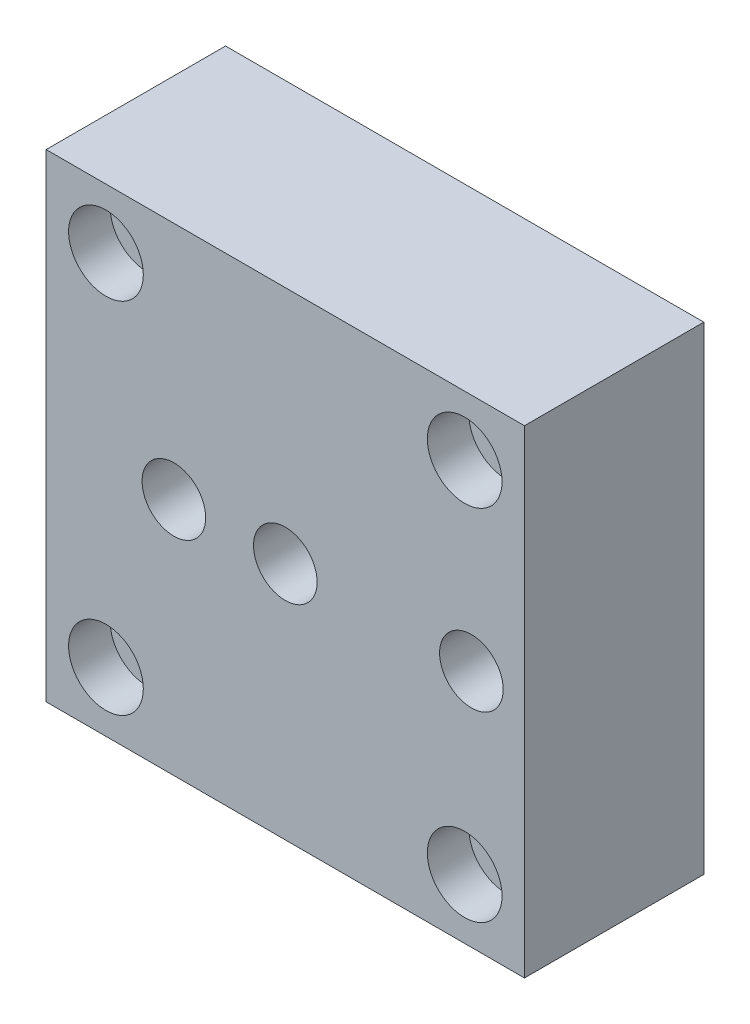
ISO-10303-21;
HEADER;
FILE_DESCRIPTION(('STEP AP214'),'2;1');
FILE_NAME('part.step','',(''),(''),'','','');
FILE_SCHEMA(('AUTOMOTIVE_DESIGN { 1 0 10303 214 1 1 1 1 }'));
ENDSEC;
DATA;
#1=APPLICATION_CONTEXT('core data for automotive mechanical design processes');
#2=APPLICATION_PROTOCOL_DEFINITION('international standard','automotive_design',2000,#1);
#3=PRODUCT_CONTEXT('',#1,'mechanical');
#4=PRODUCT('Part','Part','',(#3));
#5=PRODUCT_RELATED_PRODUCT_CATEGORY('part','',(#4));
#6=PRODUCT_DEFINITION_FORMATION('','',#4);
#7=PRODUCT_DEFINITION_CONTEXT('part definition',#1,'design');
#8=PRODUCT_DEFINITION('design','',#6,#7);
#9=PRODUCT_DEFINITION_SHAPE('','',#8);
#10=(LENGTH_UNIT() NAMED_UNIT(*) SI_UNIT(.MILLI.,.METRE.));
#11=(NAMED_UNIT(*) PLANE_ANGLE_UNIT() SI_UNIT($,.RADIAN.));
#12=(NAMED_UNIT(*) SI_UNIT($,.STERADIAN.) SOLID_ANGLE_UNIT());
#13=UNCERTAINTY_MEASURE_WITH_UNIT(LENGTH_MEASURE(1.E-05),#10,'distance_accuracy_value','');
#14=(GEOMETRIC_REPRESENTATION_CONTEXT(3) GLOBAL_UNCERTAINTY_ASSIGNED_CONTEXT((#13)) GLOBAL_UNIT_ASSIGNED_CONTEXT((#10,
#11,#12)) REPRESENTATION_CONTEXT('',''));
#15=CARTESIAN_POINT('',(0.,0.,0.));
#16=DIRECTION('',(0.,0.,1.));
#17=DIRECTION('',(1.,0.,0.));
#18=AXIS2_PLACEMENT_3D('',#15,#16,#17);
#19=CARTESIAN_POINT('',(25.4,25.4,19.05));
#20=DIRECTION('',(-1.,0.,0.));
#21=DIRECTION('',(0.,-1.,0.));
#22=AXIS2_PLACEMENT_3D('',#19,#20,#21);
#23=PLANE('',#22);
#24=DIRECTION('',(0.,1.,0.));
#25=VECTOR('',#24,1.);
#26=CARTESIAN_POINT('',(25.4,25.4,0.));
#27=LINE('',#26,#25);
#28=CARTESIAN_POINT('',(25.4,-25.4,0.));
#29=VERTEX_POINT('',#28);
#30=CARTESIAN_POINT('',(25.4,25.4,0.));
#31=VERTEX_POINT('',#30);
#32=EDGE_CURVE('E97',#29,#31,#27,.T.);
#33=ORIENTED_EDGE('',*,*,#32,.T.);
#34=DIRECTION('',(0.,0.,-1.));
#35=VECTOR('',#34,1.);
#36=CARTESIAN_POINT('',(25.4,25.4,19.05));
#37=LINE('',#36,#35);
#38=CARTESIAN_POINT('',(25.4,25.4,19.05));
#39=VERTEX_POINT('',#38);
#40=EDGE_CURVE('E11',#39,#31,#37,.T.);
#41=ORIENTED_EDGE('',*,*,#40,.F.);
#42=DIRECTION('',(0.,1.,0.));
#43=VECTOR('',#42,1.);
#44=CARTESIAN_POINT('',(25.4,25.4,19.05));
#45=LINE('',#44,#43);
#46=CARTESIAN_POINT('',(25.4,-25.4,19.05));
#47=VERTEX_POINT('',#46);
#48=EDGE_CURVE('E85',#47,#39,#45,.T.);
#49=ORIENTED_EDGE('',*,*,#48,.F.);
#50=DIRECTION('',(0.,0.,-1.));
#51=VECTOR('',#50,1.);
#52=CARTESIAN_POINT('',(25.4,-25.4,19.05));
#53=LINE('',#52,#51);
#54=EDGE_CURVE('E93',#47,#29,#53,.T.);
#55=ORIENTED_EDGE('',*,*,#54,.T.);
#56=EDGE_LOOP('',(#33,#41,#49,#55));
#57=FACE_BOUND('',#56,.T.);
#58=ADVANCED_FACE('F34',(#57),#23,.F.);
#59=CARTESIAN_POINT('',(-25.4,25.4,19.05));
#60=DIRECTION('',(0.,-1.,0.));
#61=DIRECTION('',(0.,0.,-1.));
#62=AXIS2_PLACEMENT_3D('',#59,#60,#61);
#63=PLANE('',#62);
#64=DIRECTION('',(-1.,0.,0.));
#65=VECTOR('',#64,1.);
#66=CARTESIAN_POINT('',(-25.4,25.4,0.));
#67=LINE('',#66,#65);
#68=CARTESIAN_POINT('',(-25.4,25.4,0.));
#69=VERTEX_POINT('',#68);
#70=EDGE_CURVE('E89',#31,#69,#67,.T.);
#71=ORIENTED_EDGE('',*,*,#70,.T.);
#72=DIRECTION('',(0.,0.,-1.));
#73=VECTOR('',#72,1.);
#74=CARTESIAN_POINT('',(-25.4,25.4,19.05));
#75=LINE('',#74,#73);
#76=CARTESIAN_POINT('',(-25.4,25.4,19.05));
#77=VERTEX_POINT('',#76);
#78=EDGE_CURVE('E42',#77,#69,#75,.T.);
#79=ORIENTED_EDGE('',*,*,#78,.F.);
#80=DIRECTION('',(-1.,0.,0.));
#81=VECTOR('',#80,1.);
#82=CARTESIAN_POINT('',(-25.4,25.4,19.05));
#83=LINE('',#82,#81);
#84=EDGE_CURVE('E80',#39,#77,#83,.T.);
#85=ORIENTED_EDGE('',*,*,#84,.F.);
#86=ORIENTED_EDGE('',*,*,#40,.T.);
#87=EDGE_LOOP('',(#71,#79,#85,#86));
#88=FACE_BOUND('',#87,.T.);
#89=ADVANCED_FACE('F88',(#88),#63,.F.);
#90=CARTESIAN_POINT('',(-25.4,25.4,19.05));
#91=DIRECTION('',(1.,0.,0.));
#92=DIRECTION('',(0.,1.,0.));
#93=AXIS2_PLACEMENT_3D('',#90,#91,#92);
#94=PLANE('',#93);
#95=DIRECTION('',(0.,-1.,0.));
#96=VECTOR('',#95,1.);
#97=CARTESIAN_POINT('',(-25.4,25.4,0.));
#98=LINE('',#97,#96);
#99=CARTESIAN_POINT('',(-25.4,-25.4,0.));
#100=VERTEX_POINT('',#99);
#101=EDGE_CURVE('E67',#69,#100,#98,.T.);
#102=ORIENTED_EDGE('',*,*,#101,.T.);
#103=DIRECTION('',(0.,0.,-1.));
#104=VECTOR('',#103,1.);
#105=CARTESIAN_POINT('',(-25.4,-25.4,19.05));
#106=LINE('',#105,#104);
#107=CARTESIAN_POINT('',(-25.4,-25.4,19.05));
#108=VERTEX_POINT('',#107);
#109=EDGE_CURVE('E90',#108,#100,#106,.T.);
#110=ORIENTED_EDGE('',*,*,#109,.F.);
#111=DIRECTION('',(0.,-1.,0.));
#112=VECTOR('',#111,1.);
#113=CARTESIAN_POINT('',(-25.4,25.4,19.05));
#114=LINE('',#113,#112);
#115=EDGE_CURVE('E83',#77,#108,#114,.T.);
#116=ORIENTED_EDGE('',*,*,#115,.F.);
#117=ORIENTED_EDGE('',*,*,#78,.T.);
#118=EDGE_LOOP('',(#102,#110,#116,#117));
#119=FACE_BOUND('',#118,.T.);
#120=ADVANCED_FACE('F91',(#119),#94,.F.);
#121=CARTESIAN_POINT('',(-25.4,-25.4,19.05));
#122=DIRECTION('',(0.,1.,0.));
#123=DIRECTION('',(0.,0.,1.));
#124=AXIS2_PLACEMENT_3D('',#121,#122,#123);
#125=PLANE('',#124);
#126=DIRECTION('',(1.,0.,0.));
#127=VECTOR('',#126,1.);
#128=CARTESIAN_POINT('',(-25.4,-25.4,0.));
#129=LINE('',#128,#127);
#130=EDGE_CURVE('E73',#100,#29,#129,.T.);
#131=ORIENTED_EDGE('',*,*,#130,.T.);
#132=ORIENTED_EDGE('',*,*,#54,.F.);
#133=DIRECTION('',(1.,0.,0.));
#134=VECTOR('',#133,1.);
#135=CARTESIAN_POINT('',(-25.4,-25.4,19.05));
#136=LINE('',#135,#134);
#137=EDGE_CURVE('E50',#108,#47,#136,.T.);
#138=ORIENTED_EDGE('',*,*,#137,.F.);
#139=ORIENTED_EDGE('',*,*,#109,.T.);
#140=EDGE_LOOP('',(#131,#132,#138,#139));
#141=FACE_BOUND('',#140,.T.);
#142=ADVANCED_FACE('F105',(#141),#125,.F.);
#143=CARTESIAN_POINT('',(0.,0.,19.05));
#144=DIRECTION('',(0.,0.,1.));
#145=DIRECTION('',(1.,0.,0.));
#146=AXIS2_PLACEMENT_3D('',#143,#144,#145);
#147=PLANE('',#146);
#148=CARTESIAN_POINT('',(19.7612,0.,19.05));
#149=DIRECTION('',(0.,0.,1.));
#150=DIRECTION('',(1.,0.,0.));
#151=AXIS2_PLACEMENT_3D('',#148,#149,#150);
#152=CIRCLE('',#151,3.3782);
#153=CARTESIAN_POINT('',(23.1394,0.,19.05));
#154=VERTEX_POINT('',#153);
#155=EDGE_CURVE('E171',#154,#154,#152,.T.);
#156=ORIENTED_EDGE('',*,*,#155,.F.);
#157=EDGE_LOOP('',(#156));
#158=FACE_BOUND('',#157,.T.);
#159=CARTESIAN_POINT('',(-11.8364,0.,19.05));
#160=DIRECTION('',(0.,0.,1.));
#161=DIRECTION('',(1.,0.,0.));
#162=AXIS2_PLACEMENT_3D('',#159,#160,#161);
#163=CIRCLE('',#162,3.3782);
#164=CARTESIAN_POINT('',(-8.45820000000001,0.,19.05));
#165=VERTEX_POINT('',#164);
#166=EDGE_CURVE('E165',#165,#165,#163,.T.);
#167=ORIENTED_EDGE('',*,*,#166,.F.);
#168=EDGE_LOOP('',(#167));
#169=FACE_BOUND('',#168,.T.);
#170=CARTESIAN_POINT('',(0.,0.,19.05));
#171=DIRECTION('',(0.,0.,1.));
#172=DIRECTION('',(1.,0.,0.));
#173=AXIS2_PLACEMENT_3D('',#170,#171,#172);
#174=CIRCLE('',#173,3.3782);
#175=CARTESIAN_POINT('',(3.3782,0.,19.05));
#176=VERTEX_POINT('',#175);
#177=EDGE_CURVE('E159',#176,#176,#174,.T.);
#178=ORIENTED_EDGE('',*,*,#177,.F.);
#179=EDGE_LOOP('',(#178));
#180=FACE_BOUND('',#179,.T.);
#181=CARTESIAN_POINT('',(-19.05,19.05,19.05));
#182=DIRECTION('',(0.,0.,1.));
#183=DIRECTION('',(1.,0.,0.));
#184=AXIS2_PLACEMENT_3D('',#181,#182,#183);
#185=CIRCLE('',#184,3.96875);
#186=CARTESIAN_POINT('',(-15.08125,19.05,19.05));
#187=VERTEX_POINT('',#186);
#188=EDGE_CURVE('E155',#187,#187,#185,.T.);
#189=ORIENTED_EDGE('',*,*,#188,.F.);
#190=EDGE_LOOP('',(#189));
#191=FACE_BOUND('',#190,.T.);
#192=CARTESIAN_POINT('',(19.05,19.05,19.05));
#193=DIRECTION('',(0.,0.,1.));
#194=DIRECTION('',(1.,0.,0.));
#195=AXIS2_PLACEMENT_3D('',#192,#193,#194);
#196=CIRCLE('',#195,3.96875);
#197=CARTESIAN_POINT('',(23.01875,19.05,19.05));
#198=VERTEX_POINT('',#197);
#199=EDGE_CURVE('E143',#198,#198,#196,.T.);
#200=ORIENTED_EDGE('',*,*,#199,.F.);
#201=EDGE_LOOP('',(#200));
#202=FACE_BOUND('',#201,.T.);
#203=CARTESIAN_POINT('',(-19.05,-19.05,19.05));
#204=DIRECTION('',(0.,0.,1.));
#205=DIRECTION('',(1.,0.,0.));
#206=AXIS2_PLACEMENT_3D('',#203,#204,#205);
#207=CIRCLE('',#206,3.96875);
#208=CARTESIAN_POINT('',(-15.08125,-19.05,19.05));
#209=VERTEX_POINT('',#208);
#210=EDGE_CURVE('E131',#209,#209,#207,.T.);
#211=ORIENTED_EDGE('',*,*,#210,.F.);
#212=EDGE_LOOP('',(#211));
#213=FACE_BOUND('',#212,.T.);
#214=CARTESIAN_POINT('',(19.05,-19.05,19.05));
#215=DIRECTION('',(0.,0.,1.));
#216=DIRECTION('',(1.,0.,0.));
#217=AXIS2_PLACEMENT_3D('',#214,#215,#216);
#218=CIRCLE('',#217,3.96875);
#219=CARTESIAN_POINT('',(23.01875,-19.05,19.05));
#220=VERTEX_POINT('',#219);
#221=EDGE_CURVE('E119',#220,#220,#218,.T.);
#222=ORIENTED_EDGE('',*,*,#221,.F.);
#223=EDGE_LOOP('',(#222));
#224=FACE_BOUND('',#223,.T.);
#225=ORIENTED_EDGE('',*,*,#48,.T.);
#226=ORIENTED_EDGE('',*,*,#84,.T.);
#227=ORIENTED_EDGE('',*,*,#115,.T.);
#228=ORIENTED_EDGE('',*,*,#137,.T.);
#229=EDGE_LOOP('',(#225,#226,#227,#228));
#230=FACE_BOUND('',#229,.T.);
#231=ADVANCED_FACE('F81',(#158,#169,#180,#191,#202,#213,#224,#230),#147,.T.);
#232=CARTESIAN_POINT('',(0.,0.,0.));
#233=DIRECTION('',(0.,0.,1.));
#234=DIRECTION('',(1.,0.,0.));
#235=AXIS2_PLACEMENT_3D('',#232,#233,#234);
#236=PLANE('',#235);
#237=CARTESIAN_POINT('',(19.7612,0.,0.));
#238=DIRECTION('',(0.,0.,1.));
#239=DIRECTION('',(1.,0.,0.));
#240=AXIS2_PLACEMENT_3D('',#237,#238,#239);
#241=CIRCLE('',#240,3.3782);
#242=CARTESIAN_POINT('',(23.1394,0.,0.));
#243=VERTEX_POINT('',#242);
#244=EDGE_CURVE('E162',#243,#243,#241,.T.);
#245=ORIENTED_EDGE('',*,*,#244,.T.);
#246=EDGE_LOOP('',(#245));
#247=FACE_BOUND('',#246,.T.);
#248=CARTESIAN_POINT('',(-11.8364,0.,0.));
#249=DIRECTION('',(0.,0.,1.));
#250=DIRECTION('',(1.,0.,0.));
#251=AXIS2_PLACEMENT_3D('',#248,#249,#250);
#252=CIRCLE('',#251,3.3782);
#253=CARTESIAN_POINT('',(-8.45820000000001,0.,0.));
#254=VERTEX_POINT('',#253);
#255=EDGE_CURVE('E168',#254,#254,#252,.T.);
#256=ORIENTED_EDGE('',*,*,#255,.T.);
#257=EDGE_LOOP('',(#256));
#258=FACE_BOUND('',#257,.T.);
#259=CARTESIAN_POINT('',(0.,0.,0.));
#260=DIRECTION('',(0.,0.,1.));
#261=DIRECTION('',(1.,0.,0.));
#262=AXIS2_PLACEMENT_3D('',#259,#260,#261);
#263=CIRCLE('',#262,3.3782);
#264=CARTESIAN_POINT('',(3.3782,0.,0.));
#265=VERTEX_POINT('',#264);
#266=EDGE_CURVE('E158',#265,#265,#263,.T.);
#267=ORIENTED_EDGE('',*,*,#266,.T.);
#268=EDGE_LOOP('',(#267));
#269=FACE_BOUND('',#268,.T.);
#270=CARTESIAN_POINT('',(-19.05,19.05,0.));
#271=DIRECTION('',(0.,0.,1.));
#272=DIRECTION('',(1.,0.,0.));
#273=AXIS2_PLACEMENT_3D('',#270,#271,#272);
#274=CIRCLE('',#273,2.15265);
#275=CARTESIAN_POINT('',(-16.89735,19.05,0.));
#276=VERTEX_POINT('',#275);
#277=EDGE_CURVE('E146',#276,#276,#274,.T.);
#278=ORIENTED_EDGE('',*,*,#277,.T.);
#279=EDGE_LOOP('',(#278));
#280=FACE_BOUND('',#279,.T.);
#281=CARTESIAN_POINT('',(19.05,19.05,0.));
#282=DIRECTION('',(0.,0.,1.));
#283=DIRECTION('',(1.,0.,0.));
#284=AXIS2_PLACEMENT_3D('',#281,#282,#283);
#285=CIRCLE('',#284,2.15265);
#286=CARTESIAN_POINT('',(21.20265,19.05,0.));
#287=VERTEX_POINT('',#286);
#288=EDGE_CURVE('E134',#287,#287,#285,.T.);
#289=ORIENTED_EDGE('',*,*,#288,.T.);
#290=EDGE_LOOP('',(#289));
#291=FACE_BOUND('',#290,.T.);
#292=CARTESIAN_POINT('',(-19.05,-19.05,0.));
#293=DIRECTION('',(0.,0.,1.));
#294=DIRECTION('',(1.,0.,0.));
#295=AXIS2_PLACEMENT_3D('',#292,#293,#294);
#296=CIRCLE('',#295,2.15265);
#297=CARTESIAN_POINT('',(-16.89735,-19.05,0.));
#298=VERTEX_POINT('',#297);
#299=EDGE_CURVE('E122',#298,#298,#296,.T.);
#300=ORIENTED_EDGE('',*,*,#299,.T.);
#301=EDGE_LOOP('',(#300));
#302=FACE_BOUND('',#301,.T.);
#303=CARTESIAN_POINT('',(19.05,-19.05,0.));
#304=DIRECTION('',(0.,0.,1.));
#305=DIRECTION('',(1.,0.,0.));
#306=AXIS2_PLACEMENT_3D('',#303,#304,#305);
#307=CIRCLE('',#306,2.15265);
#308=CARTESIAN_POINT('',(21.20265,-19.05,0.));
#309=VERTEX_POINT('',#308);
#310=EDGE_CURVE('E100',#309,#309,#307,.T.);
#311=ORIENTED_EDGE('',*,*,#310,.T.);
#312=EDGE_LOOP('',(#311));
#313=FACE_BOUND('',#312,.T.);
#314=ORIENTED_EDGE('',*,*,#32,.F.);
#315=ORIENTED_EDGE('',*,*,#130,.F.);
#316=ORIENTED_EDGE('',*,*,#101,.F.);
#317=ORIENTED_EDGE('',*,*,#70,.F.);
#318=EDGE_LOOP('',(#314,#315,#316,#317));
#319=FACE_BOUND('',#318,.T.);
#320=ADVANCED_FACE('F108',(#247,#258,#269,#280,#291,#302,#313,#319),#236,.F.);
#321=CARTESIAN_POINT('',(19.05,-19.05,19.05));
#322=DIRECTION('',(0.,0.,1.));
#323=DIRECTION('',(1.,0.,0.));
#324=AXIS2_PLACEMENT_3D('',#321,#322,#323);
#325=CYLINDRICAL_SURFACE('',#324,2.15265);
#326=ORIENTED_EDGE('',*,*,#310,.F.);
#327=EDGE_LOOP('',(#326));
#328=FACE_BOUND('',#327,.T.);
#329=CARTESIAN_POINT('',(19.05,-19.05,14.6304));
#330=DIRECTION('',(0.,0.,1.));
#331=DIRECTION('',(1.,0.,0.));
#332=AXIS2_PLACEMENT_3D('',#329,#330,#331);
#333=CIRCLE('',#332,2.15265000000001);
#334=CARTESIAN_POINT('',(21.20265,-19.05,14.6304));
#335=VERTEX_POINT('',#334);
#336=EDGE_CURVE('E113',#335,#335,#333,.T.);
#337=ORIENTED_EDGE('',*,*,#336,.T.);
#338=EDGE_LOOP('',(#337));
#339=FACE_BOUND('',#338,.T.);
#340=ADVANCED_FACE('F214',(#328,#339),#325,.F.);
#341=CARTESIAN_POINT('',(21.20265,-19.05,14.6304));
#342=DIRECTION('',(0.,0.,-1.));
#343=DIRECTION('',(-1.,0.,0.));
#344=AXIS2_PLACEMENT_3D('',#341,#342,#343);
#345=PLANE('',#344);
#346=ORIENTED_EDGE('',*,*,#336,.F.);
#347=EDGE_LOOP('',(#346));
#348=FACE_BOUND('',#347,.T.);
#349=CARTESIAN_POINT('',(19.05,-19.05,14.6304));
#350=DIRECTION('',(0.,0.,1.));
#351=DIRECTION('',(1.,0.,0.));
#352=AXIS2_PLACEMENT_3D('',#349,#350,#351);
#353=CIRCLE('',#352,3.96875);
#354=CARTESIAN_POINT('',(23.01875,-19.05,14.6304));
#355=VERTEX_POINT('',#354);
#356=EDGE_CURVE('E116',#355,#355,#353,.T.);
#357=ORIENTED_EDGE('',*,*,#356,.T.);
#358=EDGE_LOOP('',(#357));
#359=FACE_BOUND('',#358,.T.);
#360=ADVANCED_FACE('F204',(#348,#359),#345,.F.);
#361=CARTESIAN_POINT('',(19.05,-19.05,19.05));
#362=DIRECTION('',(0.,0.,1.));
#363=DIRECTION('',(1.,0.,0.));
#364=AXIS2_PLACEMENT_3D('',#361,#362,#363);
#365=CYLINDRICAL_SURFACE('',#364,3.96875);
#366=ORIENTED_EDGE('',*,*,#356,.F.);
#367=EDGE_LOOP('',(#366));
#368=FACE_BOUND('',#367,.T.);
#369=ORIENTED_EDGE('',*,*,#221,.T.);
#370=EDGE_LOOP('',(#369));
#371=FACE_BOUND('',#370,.T.);
#372=ADVANCED_FACE('F201',(#368,#371),#365,.F.);
#373=CARTESIAN_POINT('',(-19.05,-19.05,19.05));
#374=DIRECTION('',(0.,0.,1.));
#375=DIRECTION('',(1.,0.,0.));
#376=AXIS2_PLACEMENT_3D('',#373,#374,#375);
#377=CYLINDRICAL_SURFACE('',#376,2.15265);
#378=ORIENTED_EDGE('',*,*,#299,.F.);
#379=EDGE_LOOP('',(#378));
#380=FACE_BOUND('',#379,.T.);
#381=CARTESIAN_POINT('',(-19.05,-19.05,14.6304));
#382=DIRECTION('',(0.,0.,1.));
#383=DIRECTION('',(1.,0.,0.));
#384=AXIS2_PLACEMENT_3D('',#381,#382,#383);
#385=CIRCLE('',#384,2.15265000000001);
#386=CARTESIAN_POINT('',(-16.89735,-19.05,14.6304));
#387=VERTEX_POINT('',#386);
#388=EDGE_CURVE('E125',#387,#387,#385,.T.);
#389=ORIENTED_EDGE('',*,*,#388,.T.);
#390=EDGE_LOOP('',(#389));
#391=FACE_BOUND('',#390,.T.);
#392=ADVANCED_FACE('F203',(#380,#391),#377,.F.);
#393=CARTESIAN_POINT('',(-16.89735,-19.05,14.6304));
#394=DIRECTION('',(0.,0.,-1.));
#395=DIRECTION('',(-1.,0.,0.));
#396=AXIS2_PLACEMENT_3D('',#393,#394,#395);
#397=PLANE('',#396);
#398=ORIENTED_EDGE('',*,*,#388,.F.);
#399=EDGE_LOOP('',(#398));
#400=FACE_BOUND('',#399,.T.);
#401=CARTESIAN_POINT('',(-19.05,-19.05,14.6304));
#402=DIRECTION('',(0.,0.,1.));
#403=DIRECTION('',(1.,0.,0.));
#404=AXIS2_PLACEMENT_3D('',#401,#402,#403);
#405=CIRCLE('',#404,3.96875);
#406=CARTESIAN_POINT('',(-15.08125,-19.05,14.6304));
#407=VERTEX_POINT('',#406);
#408=EDGE_CURVE('E128',#407,#407,#405,.T.);
#409=ORIENTED_EDGE('',*,*,#408,.T.);
#410=EDGE_LOOP('',(#409));
#411=FACE_BOUND('',#410,.T.);
#412=ADVANCED_FACE('F211',(#400,#411),#397,.F.);
#413=CARTESIAN_POINT('',(-19.05,-19.05,19.05));
#414=DIRECTION('',(0.,0.,1.));
#415=DIRECTION('',(1.,0.,0.));
#416=AXIS2_PLACEMENT_3D('',#413,#414,#415);
#417=CYLINDRICAL_SURFACE('',#416,3.96875);
#418=ORIENTED_EDGE('',*,*,#408,.F.);
#419=EDGE_LOOP('',(#418));
#420=FACE_BOUND('',#419,.T.);
#421=ORIENTED_EDGE('',*,*,#210,.T.);
#422=EDGE_LOOP('',(#421));
#423=FACE_BOUND('',#422,.T.);
#424=ADVANCED_FACE('F266',(#420,#423),#417,.F.);
#425=CARTESIAN_POINT('',(19.05,19.05,19.05));
#426=DIRECTION('',(0.,0.,1.));
#427=DIRECTION('',(1.,0.,0.));
#428=AXIS2_PLACEMENT_3D('',#425,#426,#427);
#429=CYLINDRICAL_SURFACE('',#428,2.15265);
#430=ORIENTED_EDGE('',*,*,#288,.F.);
#431=EDGE_LOOP('',(#430));
#432=FACE_BOUND('',#431,.T.);
#433=CARTESIAN_POINT('',(19.05,19.05,14.6304));
#434=DIRECTION('',(0.,0.,1.));
#435=DIRECTION('',(1.,0.,0.));
#436=AXIS2_PLACEMENT_3D('',#433,#434,#435);
#437=CIRCLE('',#436,2.15265000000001);
#438=CARTESIAN_POINT('',(21.20265,19.05,14.6304));
#439=VERTEX_POINT('',#438);
#440=EDGE_CURVE('E137',#439,#439,#437,.T.);
#441=ORIENTED_EDGE('',*,*,#440,.T.);
#442=EDGE_LOOP('',(#441));
#443=FACE_BOUND('',#442,.T.);
#444=ADVANCED_FACE('F276',(#432,#443),#429,.F.);
#445=CARTESIAN_POINT('',(21.20265,19.05,14.6304));
#446=DIRECTION('',(0.,0.,-1.));
#447=DIRECTION('',(-1.,0.,0.));
#448=AXIS2_PLACEMENT_3D('',#445,#446,#447);
#449=PLANE('',#448);
#450=ORIENTED_EDGE('',*,*,#440,.F.);
#451=EDGE_LOOP('',(#450));
#452=FACE_BOUND('',#451,.T.);
#453=CARTESIAN_POINT('',(19.05,19.05,14.6304));
#454=DIRECTION('',(0.,0.,1.));
#455=DIRECTION('',(1.,0.,0.));
#456=AXIS2_PLACEMENT_3D('',#453,#454,#455);
#457=CIRCLE('',#456,3.96875);
#458=CARTESIAN_POINT('',(23.01875,19.05,14.6304));
#459=VERTEX_POINT('',#458);
#460=EDGE_CURVE('E140',#459,#459,#457,.T.);
#461=ORIENTED_EDGE('',*,*,#460,.T.);
#462=EDGE_LOOP('',(#461));
#463=FACE_BOUND('',#462,.T.);
#464=ADVANCED_FACE('F286',(#452,#463),#449,.F.);
#465=CARTESIAN_POINT('',(19.05,19.05,19.05));
#466=DIRECTION('',(0.,0.,1.));
#467=DIRECTION('',(1.,0.,0.));
#468=AXIS2_PLACEMENT_3D('',#465,#466,#467);
#469=CYLINDRICAL_SURFACE('',#468,3.96875);
#470=ORIENTED_EDGE('',*,*,#460,.F.);
#471=EDGE_LOOP('',(#470));
#472=FACE_BOUND('',#471,.T.);
#473=ORIENTED_EDGE('',*,*,#199,.T.);
#474=EDGE_LOOP('',(#473));
#475=FACE_BOUND('',#474,.T.);
#476=ADVANCED_FACE('F296',(#472,#475),#469,.F.);
#477=CARTESIAN_POINT('',(-19.05,19.05,19.05));
#478=DIRECTION('',(0.,0.,1.));
#479=DIRECTION('',(1.,0.,0.));
#480=AXIS2_PLACEMENT_3D('',#477,#478,#479);
#481=CYLINDRICAL_SURFACE('',#480,2.15265);
#482=ORIENTED_EDGE('',*,*,#277,.F.);
#483=EDGE_LOOP('',(#482));
#484=FACE_BOUND('',#483,.T.);
#485=CARTESIAN_POINT('',(-19.05,19.05,14.6304));
#486=DIRECTION('',(0.,0.,1.));
#487=DIRECTION('',(1.,0.,0.));
#488=AXIS2_PLACEMENT_3D('',#485,#486,#487);
#489=CIRCLE('',#488,2.15265000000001);
#490=CARTESIAN_POINT('',(-16.89735,19.05,14.6304));
#491=VERTEX_POINT('',#490);
#492=EDGE_CURVE('E149',#491,#491,#489,.T.);
#493=ORIENTED_EDGE('',*,*,#492,.T.);
#494=EDGE_LOOP('',(#493));
#495=FACE_BOUND('',#494,.T.);
#496=ADVANCED_FACE('F306',(#484,#495),#481,.F.);
#497=CARTESIAN_POINT('',(-16.89735,19.05,14.6304));
#498=DIRECTION('',(0.,0.,-1.));
#499=DIRECTION('',(-1.,0.,0.));
#500=AXIS2_PLACEMENT_3D('',#497,#498,#499);
#501=PLANE('',#500);
#502=ORIENTED_EDGE('',*,*,#492,.F.);
#503=EDGE_LOOP('',(#502));
#504=FACE_BOUND('',#503,.T.);
#505=CARTESIAN_POINT('',(-19.05,19.05,14.6304));
#506=DIRECTION('',(0.,0.,1.));
#507=DIRECTION('',(1.,0.,0.));
#508=AXIS2_PLACEMENT_3D('',#505,#506,#507);
#509=CIRCLE('',#508,3.96875);
#510=CARTESIAN_POINT('',(-15.08125,19.05,14.6304));
#511=VERTEX_POINT('',#510);
#512=EDGE_CURVE('E152',#511,#511,#509,.T.);
#513=ORIENTED_EDGE('',*,*,#512,.T.);
#514=EDGE_LOOP('',(#513));
#515=FACE_BOUND('',#514,.T.);
#516=ADVANCED_FACE('F316',(#504,#515),#501,.F.);
#517=CARTESIAN_POINT('',(-19.05,19.05,19.05));
#518=DIRECTION('',(0.,0.,1.));
#519=DIRECTION('',(1.,0.,0.));
#520=AXIS2_PLACEMENT_3D('',#517,#518,#519);
#521=CYLINDRICAL_SURFACE('',#520,3.96875);
#522=ORIENTED_EDGE('',*,*,#512,.F.);
#523=EDGE_LOOP('',(#522));
#524=FACE_BOUND('',#523,.T.);
#525=ORIENTED_EDGE('',*,*,#188,.T.);
#526=EDGE_LOOP('',(#525));
#527=FACE_BOUND('',#526,.T.);
#528=ADVANCED_FACE('F326',(#524,#527),#521,.F.);
#529=CARTESIAN_POINT('',(0.,0.,0.));
#530=DIRECTION('',(0.,0.,1.));
#531=DIRECTION('',(1.,0.,0.));
#532=AXIS2_PLACEMENT_3D('',#529,#530,#531);
#533=CYLINDRICAL_SURFACE('',#532,3.3782);
#534=CARTESIAN_POINT('',(3.3782,0.,0.));
#535=CARTESIAN_POINT('',(3.3782,0.,0.1984375));
#536=CARTESIAN_POINT('',(3.3782,0.,0.396875));
#537=CARTESIAN_POINT('',(3.3782,0.,0.79375));
#538=CARTESIAN_POINT('',(3.3782,0.,0.9921875));
#539=CARTESIAN_POINT('',(3.3782,0.,1.3890625));
#540=CARTESIAN_POINT('',(3.3782,0.,1.5875));
#541=CARTESIAN_POINT('',(3.3782,0.,1.984375));
#542=CARTESIAN_POINT('',(3.3782,0.,2.1828125));
#543=CARTESIAN_POINT('',(3.3782,0.,2.5796875));
#544=CARTESIAN_POINT('',(3.3782,0.,2.778125));
#545=CARTESIAN_POINT('',(3.3782,0.,3.175));
#546=CARTESIAN_POINT('',(3.3782,0.,3.3734375));
#547=CARTESIAN_POINT('',(3.3782,0.,3.7703125));
#548=CARTESIAN_POINT('',(3.3782,0.,3.96875));
#549=CARTESIAN_POINT('',(3.3782,0.,4.365625));
#550=CARTESIAN_POINT('',(3.3782,0.,4.5640625));
#551=CARTESIAN_POINT('',(3.3782,0.,4.9609375));
#552=CARTESIAN_POINT('',(3.3782,0.,5.159375));
#553=CARTESIAN_POINT('',(3.3782,0.,5.55625));
#554=CARTESIAN_POINT('',(3.3782,0.,5.7546875));
#555=CARTESIAN_POINT('',(3.3782,0.,6.1515625));
#556=CARTESIAN_POINT('',(3.3782,0.,6.35));
#557=CARTESIAN_POINT('',(3.3782,0.,6.746875));
#558=CARTESIAN_POINT('',(3.3782,0.,6.9453125));
#559=CARTESIAN_POINT('',(3.3782,0.,7.3421875));
#560=CARTESIAN_POINT('',(3.3782,0.,7.540625));
#561=CARTESIAN_POINT('',(3.3782,0.,7.9375));
#562=CARTESIAN_POINT('',(3.3782,0.,8.1359375));
#563=CARTESIAN_POINT('',(3.3782,0.,8.5328125));
#564=CARTESIAN_POINT('',(3.3782,0.,8.73125));
#565=CARTESIAN_POINT('',(3.3782,0.,9.128125));
#566=CARTESIAN_POINT('',(3.3782,0.,9.3265625));
#567=CARTESIAN_POINT('',(3.3782,0.,9.7234375));
#568=CARTESIAN_POINT('',(3.3782,0.,9.921875));
#569=CARTESIAN_POINT('',(3.3782,0.,10.31875));
#570=CARTESIAN_POINT('',(3.3782,0.,10.5171875));
#571=CARTESIAN_POINT('',(3.3782,0.,10.9140625));
#572=CARTESIAN_POINT('',(3.3782,0.,11.1125));
#573=CARTESIAN_POINT('',(3.3782,0.,11.509375));
#574=CARTESIAN_POINT('',(3.3782,0.,11.7078125));
#575=CARTESIAN_POINT('',(3.3782,0.,12.1046875));
#576=CARTESIAN_POINT('',(3.3782,0.,12.303125));
#577=CARTESIAN_POINT('',(3.3782,0.,12.7));
#578=CARTESIAN_POINT('',(3.3782,0.,12.8984375));
#579=CARTESIAN_POINT('',(3.3782,0.,13.2953125));
#580=CARTESIAN_POINT('',(3.3782,0.,13.49375));
#581=CARTESIAN_POINT('',(3.3782,0.,13.890625));
#582=CARTESIAN_POINT('',(3.3782,0.,14.0890625));
#583=CARTESIAN_POINT('',(3.3782,0.,14.4859375));
#584=CARTESIAN_POINT('',(3.3782,0.,14.684375));
#585=CARTESIAN_POINT('',(3.3782,0.,15.08125));
#586=CARTESIAN_POINT('',(3.3782,0.,15.2796875));
#587=CARTESIAN_POINT('',(3.3782,0.,15.6765625));
#588=CARTESIAN_POINT('',(3.3782,0.,15.875));
#589=CARTESIAN_POINT('',(3.3782,0.,16.271875));
#590=CARTESIAN_POINT('',(3.3782,0.,16.4703125));
#591=CARTESIAN_POINT('',(3.3782,0.,16.8671875));
#592=CARTESIAN_POINT('',(3.3782,0.,17.065625));
#593=CARTESIAN_POINT('',(3.3782,0.,17.4625));
#594=CARTESIAN_POINT('',(3.3782,0.,17.6609375));
#595=CARTESIAN_POINT('',(3.3782,0.,18.0578125));
#596=CARTESIAN_POINT('',(3.3782,0.,18.25625));
#597=CARTESIAN_POINT('',(3.3782,0.,18.653125));
#598=CARTESIAN_POINT('',(3.3782,0.,18.8515625));
#599=CARTESIAN_POINT('',(3.3782,0.,19.05));
#600=B_SPLINE_CURVE_WITH_KNOTS('',3,(#534,#535,#536,#537,#538,#539,#540,#541,#542,#543,#544,
#545,#546,#547,#548,#549,#550,#551,#552,#553,#554,#555,#556,#557,#558,#559,#560,#561,#562,#563,
#564,#565,#566,#567,#568,#569,#570,#571,#572,#573,#574,#575,#576,#577,#578,#579,#580,#581,#582,
#583,#584,#585,#586,#587,#588,#589,#590,#591,#592,#593,#594,#595,#596,#597,#598,#599),
.UNSPECIFIED.,.F.,.F.,(4,2,2,2,2,2,2,2,2,2,2,2,2,2,2,2,2,2,2,2,2,2,2,2,2,2,2,2,2,2,2,2,4),(0.,
0.5953125,1.190625,1.7859375,2.38125,2.9765625,3.571875,4.1671875,4.7625,5.3578125,5.953125,
6.5484375,7.14375,7.7390625,8.334375,8.9296875,9.525,10.1203125,10.715625,11.3109375,11.90625,
12.5015625,13.096875,13.6921875,14.2875,14.8828125,15.478125,16.0734375,16.66875,17.2640625,
17.859375,18.4546875,19.05),.UNSPECIFIED.);
#601=EDGE_CURVE('BSEAM336',#265,#176,#600,.T.);
#602=ORIENTED_EDGE('',*,*,#266,.F.);
#603=ORIENTED_EDGE('',*,*,#177,.T.);
#604=ORIENTED_EDGE('',*,*,#601,.T.);
#605=ORIENTED_EDGE('',*,*,#601,.F.);
#606=EDGE_LOOP('',(#602,#604,#603,#605));
#607=FACE_BOUND('',#606,.T.);
#608=ADVANCED_FACE('F336',(#607),#533,.F.);
#609=CARTESIAN_POINT('',(-11.8364,0.,0.));
#610=DIRECTION('',(0.,0.,1.));
#611=DIRECTION('',(1.,0.,0.));
#612=AXIS2_PLACEMENT_3D('',#609,#610,#611);
#613=CYLINDRICAL_SURFACE('',#612,3.3782);
#614=CARTESIAN_POINT('',(-8.45820000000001,0.,0.));
#615=CARTESIAN_POINT('',(-8.45820000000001,0.,0.1984375));
#616=CARTESIAN_POINT('',(-8.45820000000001,0.,0.396875));
#617=CARTESIAN_POINT('',(-8.45820000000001,0.,0.79375));
#618=CARTESIAN_POINT('',(-8.45820000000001,0.,0.9921875));
#619=CARTESIAN_POINT('',(-8.45820000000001,0.,1.3890625));
#620=CARTESIAN_POINT('',(-8.45820000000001,0.,1.5875));
#621=CARTESIAN_POINT('',(-8.45820000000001,0.,1.984375));
#622=CARTESIAN_POINT('',(-8.45820000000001,0.,2.1828125));
#623=CARTESIAN_POINT('',(-8.45820000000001,0.,2.5796875));
#624=CARTESIAN_POINT('',(-8.45820000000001,0.,2.778125));
#625=CARTESIAN_POINT('',(-8.45820000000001,0.,3.175));
#626=CARTESIAN_POINT('',(-8.45820000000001,0.,3.3734375));
#627=CARTESIAN_POINT('',(-8.45820000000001,0.,3.7703125));
#628=CARTESIAN_POINT('',(-8.45820000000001,0.,3.96875));
#629=CARTESIAN_POINT('',(-8.45820000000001,0.,4.365625));
#630=CARTESIAN_POINT('',(-8.45820000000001,0.,4.5640625));
#631=CARTESIAN_POINT('',(-8.45820000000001,0.,4.9609375));
#632=CARTESIAN_POINT('',(-8.45820000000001,0.,5.159375));
#633=CARTESIAN_POINT('',(-8.45820000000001,0.,5.55625));
#634=CARTESIAN_POINT('',(-8.45820000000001,0.,5.7546875));
#635=CARTESIAN_POINT('',(-8.45820000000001,0.,6.1515625));
#636=CARTESIAN_POINT('',(-8.45820000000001,0.,6.35));
#637=CARTESIAN_POINT('',(-8.45820000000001,0.,6.746875));
#638=CARTESIAN_POINT('',(-8.45820000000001,0.,6.9453125));
#639=CARTESIAN_POINT('',(-8.45820000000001,0.,7.3421875));
#640=CARTESIAN_POINT('',(-8.45820000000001,0.,7.540625));
#641=CARTESIAN_POINT('',(-8.45820000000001,0.,7.9375));
#642=CARTESIAN_POINT('',(-8.45820000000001,0.,8.1359375));
#643=CARTESIAN_POINT('',(-8.45820000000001,0.,8.5328125));
#644=CARTESIAN_POINT('',(-8.45820000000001,0.,8.73125));
#645=CARTESIAN_POINT('',(-8.45820000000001,0.,9.128125));
#646=CARTESIAN_POINT('',(-8.45820000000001,0.,9.3265625));
#647=CARTESIAN_POINT('',(-8.45820000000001,0.,9.7234375));
#648=CARTESIAN_POINT('',(-8.45820000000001,0.,9.921875));
#649=CARTESIAN_POINT('',(-8.45820000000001,0.,10.31875));
#650=CARTESIAN_POINT('',(-8.45820000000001,0.,10.5171875));
#651=CARTESIAN_POINT('',(-8.45820000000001,0.,10.9140625));
#652=CARTESIAN_POINT('',(-8.45820000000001,0.,11.1125));
#653=CARTESIAN_POINT('',(-8.45820000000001,0.,11.509375));
#654=CARTESIAN_POINT('',(-8.45820000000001,0.,11.7078125));
#655=CARTESIAN_POINT('',(-8.45820000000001,0.,12.1046875));
#656=CARTESIAN_POINT('',(-8.45820000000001,0.,12.303125));
#657=CARTESIAN_POINT('',(-8.45820000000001,0.,12.7));
#658=CARTESIAN_POINT('',(-8.45820000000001,0.,12.8984375));
#659=CARTESIAN_POINT('',(-8.45820000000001,0.,13.2953125));
#660=CARTESIAN_POINT('',(-8.45820000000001,0.,13.49375));
#661=CARTESIAN_POINT('',(-8.45820000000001,0.,13.890625));
#662=CARTESIAN_POINT('',(-8.45820000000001,0.,14.0890625));
#663=CARTESIAN_POINT('',(-8.45820000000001,0.,14.4859375));
#664=CARTESIAN_POINT('',(-8.45820000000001,0.,14.684375));
#665=CARTESIAN_POINT('',(-8.45820000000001,0.,15.08125));
#666=CARTESIAN_POINT('',(-8.45820000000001,0.,15.2796875));
#667=CARTESIAN_POINT('',(-8.45820000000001,0.,15.6765625));
#668=CARTESIAN_POINT('',(-8.45820000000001,0.,15.875));
#669=CARTESIAN_POINT('',(-8.45820000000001,0.,16.271875));
#670=CARTESIAN_POINT('',(-8.45820000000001,0.,16.4703125));
#671=CARTESIAN_POINT('',(-8.45820000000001,0.,16.8671875));
#672=CARTESIAN_POINT('',(-8.45820000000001,0.,17.065625));
#673=CARTESIAN_POINT('',(-8.45820000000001,0.,17.4625));
#674=CARTESIAN_POINT('',(-8.45820000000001,0.,17.6609375));
#675=CARTESIAN_POINT('',(-8.45820000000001,0.,18.0578125));
#676=CARTESIAN_POINT('',(-8.45820000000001,0.,18.25625));
#677=CARTESIAN_POINT('',(-8.45820000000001,0.,18.653125));
#678=CARTESIAN_POINT('',(-8.45820000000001,0.,18.8515625));
#679=CARTESIAN_POINT('',(-8.45820000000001,0.,19.05));
#680=B_SPLINE_CURVE_WITH_KNOTS('',3,(#614,#615,#616,#617,#618,#619,#620,#621,#622,#623,#624,
#625,#626,#627,#628,#629,#630,#631,#632,#633,#634,#635,#636,#637,#638,#639,#640,#641,#642,#643,
#644,#645,#646,#647,#648,#649,#650,#651,#652,#653,#654,#655,#656,#657,#658,#659,#660,#661,#662,
#663,#664,#665,#666,#667,#668,#669,#670,#671,#672,#673,#674,#675,#676,#677,#678,#679),
.UNSPECIFIED.,.F.,.F.,(4,2,2,2,2,2,2,2,2,2,2,2,2,2,2,2,2,2,2,2,2,2,2,2,2,2,2,2,2,2,2,2,4),(0.,
0.5953125,1.190625,1.7859375,2.38125,2.9765625,3.571875,4.1671875,4.7625,5.3578125,5.953125,
6.5484375,7.14375,7.7390625,8.334375,8.9296875,9.525,10.1203125,10.715625,11.3109375,11.90625,
12.5015625,13.096875,13.6921875,14.2875,14.8828125,15.478125,16.0734375,16.66875,17.2640625,
17.859375,18.4546875,19.05),.UNSPECIFIED.);
#681=EDGE_CURVE('BSEAM182',#254,#165,#680,.T.);
#682=ORIENTED_EDGE('',*,*,#255,.F.);
#683=ORIENTED_EDGE('',*,*,#166,.T.);
#684=ORIENTED_EDGE('',*,*,#681,.T.);
#685=ORIENTED_EDGE('',*,*,#681,.F.);
#686=EDGE_LOOP('',(#682,#684,#683,#685));
#687=FACE_BOUND('',#686,.T.);
#688=ADVANCED_FACE('F182',(#687),#613,.F.);
#689=CARTESIAN_POINT('',(19.7612,0.,0.));
#690=DIRECTION('',(0.,0.,1.));
#691=DIRECTION('',(1.,0.,0.));
#692=AXIS2_PLACEMENT_3D('',#689,#690,#691);
#693=CYLINDRICAL_SURFACE('',#692,3.3782);
#694=CARTESIAN_POINT('',(23.1394,0.,0.));
#695=CARTESIAN_POINT('',(23.1394,0.,0.1984375));
#696=CARTESIAN_POINT('',(23.1394,0.,0.396875));
#697=CARTESIAN_POINT('',(23.1394,0.,0.79375));
#698=CARTESIAN_POINT('',(23.1394,0.,0.9921875));
#699=CARTESIAN_POINT('',(23.1394,0.,1.3890625));
#700=CARTESIAN_POINT('',(23.1394,0.,1.5875));
#701=CARTESIAN_POINT('',(23.1394,0.,1.984375));
#702=CARTESIAN_POINT('',(23.1394,0.,2.1828125));
#703=CARTESIAN_POINT('',(23.1394,0.,2.5796875));
#704=CARTESIAN_POINT('',(23.1394,0.,2.778125));
#705=CARTESIAN_POINT('',(23.1394,0.,3.175));
#706=CARTESIAN_POINT('',(23.1394,0.,3.3734375));
#707=CARTESIAN_POINT('',(23.1394,0.,3.7703125));
#708=CARTESIAN_POINT('',(23.1394,0.,3.96875));
#709=CARTESIAN_POINT('',(23.1394,0.,4.365625));
#710=CARTESIAN_POINT('',(23.1394,0.,4.5640625));
#711=CARTESIAN_POINT('',(23.1394,0.,4.9609375));
#712=CARTESIAN_POINT('',(23.1394,0.,5.159375));
#713=CARTESIAN_POINT('',(23.1394,0.,5.55625));
#714=CARTESIAN_POINT('',(23.1394,0.,5.7546875));
#715=CARTESIAN_POINT('',(23.1394,0.,6.1515625));
#716=CARTESIAN_POINT('',(23.1394,0.,6.35));
#717=CARTESIAN_POINT('',(23.1394,0.,6.746875));
#718=CARTESIAN_POINT('',(23.1394,0.,6.9453125));
#719=CARTESIAN_POINT('',(23.1394,0.,7.3421875));
#720=CARTESIAN_POINT('',(23.1394,0.,7.540625));
#721=CARTESIAN_POINT('',(23.1394,0.,7.9375));
#722=CARTESIAN_POINT('',(23.1394,0.,8.1359375));
#723=CARTESIAN_POINT('',(23.1394,0.,8.5328125));
#724=CARTESIAN_POINT('',(23.1394,0.,8.73125));
#725=CARTESIAN_POINT('',(23.1394,0.,9.128125));
#726=CARTESIAN_POINT('',(23.1394,0.,9.3265625));
#727=CARTESIAN_POINT('',(23.1394,0.,9.7234375));
#728=CARTESIAN_POINT('',(23.1394,0.,9.921875));
#729=CARTESIAN_POINT('',(23.1394,0.,10.31875));
#730=CARTESIAN_POINT('',(23.1394,0.,10.5171875));
#731=CARTESIAN_POINT('',(23.1394,0.,10.9140625));
#732=CARTESIAN_POINT('',(23.1394,0.,11.1125));
#733=CARTESIAN_POINT('',(23.1394,0.,11.509375));
#734=CARTESIAN_POINT('',(23.1394,0.,11.7078125));
#735=CARTESIAN_POINT('',(23.1394,0.,12.1046875));
#736=CARTESIAN_POINT('',(23.1394,0.,12.303125));
#737=CARTESIAN_POINT('',(23.1394,0.,12.7));
#738=CARTESIAN_POINT('',(23.1394,0.,12.8984375));
#739=CARTESIAN_POINT('',(23.1394,0.,13.2953125));
#740=CARTESIAN_POINT('',(23.1394,0.,13.49375));
#741=CARTESIAN_POINT('',(23.1394,0.,13.890625));
#742=CARTESIAN_POINT('',(23.1394,0.,14.0890625));
#743=CARTESIAN_POINT('',(23.1394,0.,14.4859375));
#744=CARTESIAN_POINT('',(23.1394,0.,14.684375));
#745=CARTESIAN_POINT('',(23.1394,0.,15.08125));
#746=CARTESIAN_POINT('',(23.1394,0.,15.2796875));
#747=CARTESIAN_POINT('',(23.1394,0.,15.6765625));
#748=CARTESIAN_POINT('',(23.1394,0.,15.875));
#749=CARTESIAN_POINT('',(23.1394,0.,16.271875));
#750=CARTESIAN_POINT('',(23.1394,0.,16.4703125));
#751=CARTESIAN_POINT('',(23.1394,0.,16.8671875));
#752=CARTESIAN_POINT('',(23.1394,0.,17.065625));
#753=CARTESIAN_POINT('',(23.1394,0.,17.4625));
#754=CARTESIAN_POINT('',(23.1394,0.,17.6609375));
#755=CARTESIAN_POINT('',(23.1394,0.,18.0578125));
#756=CARTESIAN_POINT('',(23.1394,0.,18.25625));
#757=CARTESIAN_POINT('',(23.1394,0.,18.653125));
#758=CARTESIAN_POINT('',(23.1394,0.,18.8515625));
#759=CARTESIAN_POINT('',(23.1394,0.,19.05));
#760=B_SPLINE_CURVE_WITH_KNOTS('',3,(#694,#695,#696,#697,#698,#699,#700,#701,#702,#703,#704,
#705,#706,#707,#708,#709,#710,#711,#712,#713,#714,#715,#716,#717,#718,#719,#720,#721,#722,#723,
#724,#725,#726,#727,#728,#729,#730,#731,#732,#733,#734,#735,#736,#737,#738,#739,#740,#741,#742,
#743,#744,#745,#746,#747,#748,#749,#750,#751,#752,#753,#754,#755,#756,#757,#758,#759),
.UNSPECIFIED.,.F.,.F.,(4,2,2,2,2,2,2,2,2,2,2,2,2,2,2,2,2,2,2,2,2,2,2,2,2,2,2,2,2,2,2,2,4),(0.,
0.5953125,1.190625,1.7859375,2.38125,2.9765625,3.571875,4.1671875,4.7625,5.3578125,5.953125,
6.5484375,7.14375,7.7390625,8.334375,8.9296875,9.525,10.1203125,10.715625,11.3109375,11.90625,
12.5015625,13.096875,13.6921875,14.2875,14.8828125,15.478125,16.0734375,16.66875,17.2640625,
17.859375,18.4546875,19.05),.UNSPECIFIED.);
#761=EDGE_CURVE('BSEAM179',#243,#154,#760,.T.);
#762=ORIENTED_EDGE('',*,*,#244,.F.);
#763=ORIENTED_EDGE('',*,*,#155,.T.);
#764=ORIENTED_EDGE('',*,*,#761,.T.);
#765=ORIENTED_EDGE('',*,*,#761,.F.);
#766=EDGE_LOOP('',(#762,#764,#763,#765));
#767=FACE_BOUND('',#766,.T.);
#768=ADVANCED_FACE('F179',(#767),#693,.F.);
#769=CLOSED_SHELL('',(#58,#89,#120,#142,#231,#320,#340,#360,#372,#392,#412,#424,#444,#464,#476,
#496,#516,#528,#608,#688,#768));
#770=MANIFOLD_SOLID_BREP('B2',#769);
#771=ADVANCED_BREP_SHAPE_REPRESENTATION('',(#18,#770),#14);
#772=SHAPE_DEFINITION_REPRESENTATION(#9,#771);
ENDSEC;
END-ISO-10303-21;
